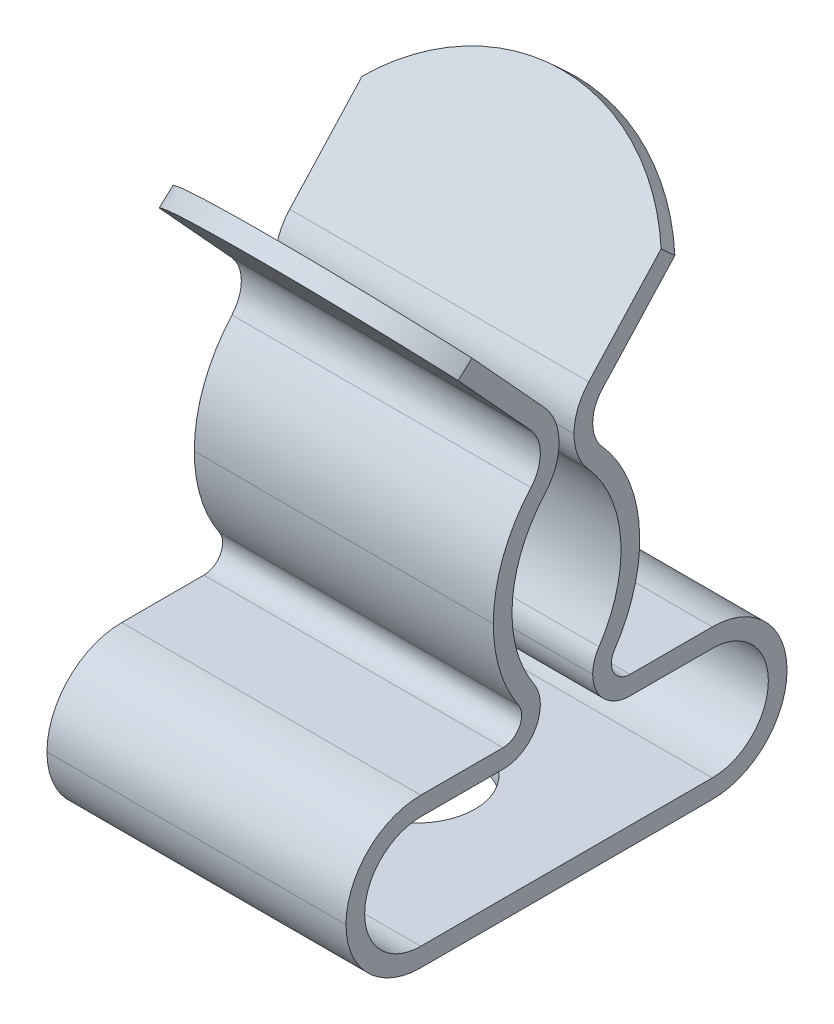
ISO-10303-21;
HEADER;
FILE_DESCRIPTION(('STEP AP214'),'2;1');
FILE_NAME('part.step','',(''),(''),'','','');
FILE_SCHEMA(('AUTOMOTIVE_DESIGN { 1 0 10303 214 1 1 1 1 }'));
ENDSEC;
DATA;
#1=APPLICATION_CONTEXT('core data for automotive mechanical design processes');
#2=APPLICATION_PROTOCOL_DEFINITION('international standard','automotive_design',2000,#1);
#3=PRODUCT_CONTEXT('',#1,'mechanical');
#4=PRODUCT('Part','Part','',(#3));
#5=PRODUCT_RELATED_PRODUCT_CATEGORY('part','',(#4));
#6=PRODUCT_DEFINITION_FORMATION('','',#4);
#7=PRODUCT_DEFINITION_CONTEXT('part definition',#1,'design');
#8=PRODUCT_DEFINITION('design','',#6,#7);
#9=PRODUCT_DEFINITION_SHAPE('','',#8);
#10=(LENGTH_UNIT() NAMED_UNIT(*) SI_UNIT(.MILLI.,.METRE.));
#11=(NAMED_UNIT(*) PLANE_ANGLE_UNIT() SI_UNIT($,.RADIAN.));
#12=(NAMED_UNIT(*) SI_UNIT($,.STERADIAN.) SOLID_ANGLE_UNIT());
#13=UNCERTAINTY_MEASURE_WITH_UNIT(LENGTH_MEASURE(1.E-05),#10,'distance_accuracy_value','');
#14=(GEOMETRIC_REPRESENTATION_CONTEXT(3) GLOBAL_UNCERTAINTY_ASSIGNED_CONTEXT((#13)) GLOBAL_UNIT_ASSIGNED_CONTEXT((#10,
#11,#12)) REPRESENTATION_CONTEXT('',''));
#15=CARTESIAN_POINT('',(0.,0.,0.));
#16=DIRECTION('',(0.,0.,1.));
#17=DIRECTION('',(1.,0.,0.));
#18=AXIS2_PLACEMENT_3D('',#15,#16,#17);
#19=CARTESIAN_POINT('',(36.4639094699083,-12.2939015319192,0.));
#20=DIRECTION('',(0.,-1.,0.));
#21=DIRECTION('',(-1.,0.,0.));
#22=AXIS2_PLACEMENT_3D('',#19,#20,#21);
#23=CYLINDRICAL_SURFACE('',#22,1.55);
#24=DIRECTION('',(0.,-1.,0.));
#25=VECTOR('',#24,1.);
#26=CARTESIAN_POINT('',(38.0139094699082,-12.2939015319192,0.));
#27=LINE('',#26,#25);
#28=CARTESIAN_POINT('',(38.0139094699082,-11.7939015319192,0.));
#29=VERTEX_POINT('',#28);
#30=CARTESIAN_POINT('',(38.0139094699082,-12.2939015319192,0.));
#31=VERTEX_POINT('',#30);
#32=EDGE_CURVE('E719',#29,#31,#27,.T.);
#33=ORIENTED_EDGE('',*,*,#32,.F.);
#34=CARTESIAN_POINT('',(36.4639094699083,-11.7939015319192,0.));
#35=DIRECTION('',(0.,1.,0.));
#36=DIRECTION('',(1.,0.,0.));
#37=AXIS2_PLACEMENT_3D('',#34,#35,#36);
#38=CIRCLE('',#37,1.55);
#39=CARTESIAN_POINT('',(34.9139094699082,-11.7939015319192,0.));
#40=VERTEX_POINT('',#39);
#41=EDGE_CURVE('E690',#29,#40,#38,.T.);
#42=ORIENTED_EDGE('',*,*,#41,.T.);
#43=DIRECTION('',(0.,-1.,0.));
#44=VECTOR('',#43,1.);
#45=CARTESIAN_POINT('',(34.9139094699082,-12.2939015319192,0.));
#46=LINE('',#45,#44);
#47=CARTESIAN_POINT('',(34.9139094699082,-12.2939015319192,0.));
#48=VERTEX_POINT('',#47);
#49=EDGE_CURVE('E718',#40,#48,#46,.T.);
#50=ORIENTED_EDGE('',*,*,#49,.T.);
#51=CARTESIAN_POINT('',(36.4639094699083,-12.2939015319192,0.));
#52=DIRECTION('',(0.,-1.,0.));
#53=DIRECTION('',(-1.,0.,0.));
#54=AXIS2_PLACEMENT_3D('',#51,#52,#53);
#55=CIRCLE('',#54,1.55);
#56=EDGE_CURVE('E375',#48,#31,#55,.T.);
#57=ORIENTED_EDGE('',*,*,#56,.T.);
#58=EDGE_LOOP('',(#33,#42,#50,#57));
#59=FACE_BOUND('',#58,.T.);
#60=ADVANCED_FACE('F15',(#59),#23,.F.);
#61=CARTESIAN_POINT('',(36.4639094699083,3.80922573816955,-4.81352127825));
#62=DIRECTION('',(0.,-0.675590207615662,0.737277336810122));
#63=DIRECTION('',(0.,-0.737277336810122,-0.675590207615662));
#64=AXIS2_PLACEMENT_3D('',#61,#62,#63);
#65=CYLINDRICAL_SURFACE('',#64,5.);
#66=CARTESIAN_POINT('',(36.4639094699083,-1.0628444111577,0.503410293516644));
#67=DIRECTION('',(0.,-0.675590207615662,0.737277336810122));
#68=DIRECTION('',(0.,0.737277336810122,0.675590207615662));
#69=AXIS2_PLACEMENT_3D('',#66,#67,#68);
#70=CIRCLE('',#69,5.);
#71=CARTESIAN_POINT('',(40.4639094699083,1.1489875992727,2.53018091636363));
#72=VERTEX_POINT('',#71);
#73=CARTESIAN_POINT('',(32.4639094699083,1.14898759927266,2.53018091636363));
#74=VERTEX_POINT('',#73);
#75=EDGE_CURVE('E541',#72,#74,#70,.T.);
#76=ORIENTED_EDGE('',*,*,#75,.T.);
#77=DIRECTION('',(0.,-0.675590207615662,0.737277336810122));
#78=VECTOR('',#77,1.);
#79=CARTESIAN_POINT('',(32.4639094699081,6.02105774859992,-2.78675065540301));
#80=LINE('',#79,#78);
#81=CARTESIAN_POINT('',(32.4639094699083,0.811192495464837,2.89881958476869));
#82=VERTEX_POINT('',#81);
#83=EDGE_CURVE('E568',#74,#82,#80,.T.);
#84=ORIENTED_EDGE('',*,*,#83,.T.);
#85=CARTESIAN_POINT('',(36.4639094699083,-1.40063951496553,0.872048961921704));
#86=DIRECTION('',(0.,0.675590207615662,-0.737277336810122));
#87=DIRECTION('',(0.,-0.737277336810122,-0.675590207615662));
#88=AXIS2_PLACEMENT_3D('',#85,#86,#87);
#89=CIRCLE('',#88,5.);
#90=CARTESIAN_POINT('',(40.4639094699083,0.811192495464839,2.89881958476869));
#91=VERTEX_POINT('',#90);
#92=EDGE_CURVE('E561',#82,#91,#89,.T.);
#93=ORIENTED_EDGE('',*,*,#92,.T.);
#94=DIRECTION('',(0.,-0.675590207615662,0.737277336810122));
#95=VECTOR('',#94,1.);
#96=CARTESIAN_POINT('',(40.4639094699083,6.02105774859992,-2.78675065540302));
#97=LINE('',#96,#95);
#98=EDGE_CURVE('E354',#72,#91,#97,.T.);
#99=ORIENTED_EDGE('',*,*,#98,.F.);
#100=EDGE_LOOP('',(#76,#84,#93,#99));
#101=FACE_BOUND('',#100,.T.);
#102=ADVANCED_FACE('F797',(#101),#65,.T.);
#103=CARTESIAN_POINT('',(36.4639094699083,3.80922573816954,4.81352127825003));
#104=DIRECTION('',(0.,-0.675590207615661,-0.737277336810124));
#105=DIRECTION('',(0.,0.737277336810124,-0.675590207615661));
#106=AXIS2_PLACEMENT_3D('',#103,#104,#105);
#107=CYLINDRICAL_SURFACE('',#106,5.);
#108=DIRECTION('',(0.,-0.675590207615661,-0.737277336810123));
#109=VECTOR('',#108,1.);
#110=CARTESIAN_POINT('',(36.4639094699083,7.49561242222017,1.43557024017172));
#111=LINE('',#110,#109);
#112=CARTESIAN_POINT('',(36.4639094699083,2.62354227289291,-3.88136133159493));
#113=VERTEX_POINT('',#112);
#114=CARTESIAN_POINT('',(36.4639094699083,2.28574716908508,-4.25));
#115=VERTEX_POINT('',#114);
#116=EDGE_CURVE('E332',#113,#115,#111,.T.);
#117=ORIENTED_EDGE('',*,*,#116,.F.);
#118=CARTESIAN_POINT('',(36.4639094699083,-1.06284441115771,-0.503410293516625));
#119=DIRECTION('',(0.,-0.675590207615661,-0.737277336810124));
#120=DIRECTION('',(0.,-0.737277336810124,0.675590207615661));
#121=AXIS2_PLACEMENT_3D('',#118,#119,#120);
#122=CIRCLE('',#121,5.);
#123=CARTESIAN_POINT('',(40.4639094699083,1.14898759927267,-2.53018091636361));
#124=VERTEX_POINT('',#123);
#125=EDGE_CURVE('E474',#113,#124,#122,.T.);
#126=ORIENTED_EDGE('',*,*,#125,.T.);
#127=DIRECTION('',(0.,-0.675590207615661,-0.737277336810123));
#128=VECTOR('',#127,1.);
#129=CARTESIAN_POINT('',(40.4639094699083,6.02105774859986,2.78675065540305));
#130=LINE('',#129,#128);
#131=CARTESIAN_POINT('',(40.4639094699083,0.811192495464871,-2.89881958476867));
#132=VERTEX_POINT('',#131);
#133=EDGE_CURVE('E614',#124,#132,#130,.T.);
#134=ORIENTED_EDGE('',*,*,#133,.T.);
#135=CARTESIAN_POINT('',(36.4639094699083,-1.40063951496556,-0.872048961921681));
#136=DIRECTION('',(0.,0.675590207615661,0.737277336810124));
#137=DIRECTION('',(0.,-0.737277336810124,0.675590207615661));
#138=AXIS2_PLACEMENT_3D('',#135,#136,#137);
#139=CIRCLE('',#138,5.);
#140=EDGE_CURVE('E644',#132,#115,#139,.T.);
#141=ORIENTED_EDGE('',*,*,#140,.T.);
#142=EDGE_LOOP('',(#117,#126,#134,#141));
#143=FACE_BOUND('',#142,.T.);
#144=ADVANCED_FACE('F755',(#143),#107,.T.);
#145=CARTESIAN_POINT('',(40.4639094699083,-1.97727674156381,-1.7));
#146=DIRECTION('',(-1.,0.,0.));
#147=DIRECTION('',(0.,0.,1.));
#148=AXIS2_PLACEMENT_3D('',#145,#146,#147);
#149=CYLINDRICAL_SURFACE('',#148,1.);
#150=DIRECTION('',(-1.,0.,0.));
#151=VECTOR('',#150,1.);
#152=CARTESIAN_POINT('',(40.4639094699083,-1.97727674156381,-0.69999999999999));
#153=LINE('',#152,#151);
#154=CARTESIAN_POINT('',(40.4639094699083,-1.97727674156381,-0.69999999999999));
#155=VERTEX_POINT('',#154);
#156=CARTESIAN_POINT('',(32.4639094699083,-1.97727674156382,-0.69999999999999));
#157=VERTEX_POINT('',#156);
#158=EDGE_CURVE('E366',#155,#157,#153,.T.);
#159=ORIENTED_EDGE('',*,*,#158,.F.);
#160=CARTESIAN_POINT('',(40.4639094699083,-1.97727674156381,-1.7));
#161=DIRECTION('',(-1.,0.,0.));
#162=DIRECTION('',(0.,0.,1.));
#163=AXIS2_PLACEMENT_3D('',#160,#161,#162);
#164=CIRCLE('',#163,1.);
#165=CARTESIAN_POINT('',(40.4639094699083,-2.6406016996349,-0.951668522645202));
#166=VERTEX_POINT('',#165);
#167=EDGE_CURVE('E607',#166,#155,#164,.T.);
#168=ORIENTED_EDGE('',*,*,#167,.F.);
#169=DIRECTION('',(-1.,0.,0.));
#170=VECTOR('',#169,1.);
#171=CARTESIAN_POINT('',(40.4639094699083,-2.6406016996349,-0.951668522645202));
#172=LINE('',#171,#170);
#173=CARTESIAN_POINT('',(32.4639094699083,-2.6406016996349,-0.951668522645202));
#174=VERTEX_POINT('',#173);
#175=EDGE_CURVE('E10',#166,#174,#172,.T.);
#176=ORIENTED_EDGE('',*,*,#175,.T.);
#177=CARTESIAN_POINT('',(32.4639094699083,-1.97727674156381,-1.7));
#178=DIRECTION('',(-1.,0.,0.));
#179=DIRECTION('',(0.,0.,1.));
#180=AXIS2_PLACEMENT_3D('',#177,#178,#179);
#181=CIRCLE('',#180,1.);
#182=EDGE_CURVE('E670',#174,#157,#181,.T.);
#183=ORIENTED_EDGE('',*,*,#182,.T.);
#184=EDGE_LOOP('',(#159,#168,#176,#183));
#185=FACE_BOUND('',#184,.T.);
#186=ADVANCED_FACE('F794',(#185),#149,.F.);
#187=CARTESIAN_POINT('',(40.4639094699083,-5.29390153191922,2.04165738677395));
#188=DIRECTION('',(-1.,0.,0.));
#189=DIRECTION('',(0.,0.,1.));
#190=AXIS2_PLACEMENT_3D('',#187,#188,#189);
#191=CYLINDRICAL_SURFACE('',#190,4.);
#192=CARTESIAN_POINT('',(32.4639094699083,-5.29390153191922,2.04165738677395));
#193=DIRECTION('',(1.,0.,0.));
#194=DIRECTION('',(0.,0.,-1.));
#195=AXIS2_PLACEMENT_3D('',#192,#193,#194);
#196=CIRCLE('',#195,4.);
#197=CARTESIAN_POINT('',(32.4639094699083,-7.51612375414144,-1.28426029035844));
#198=VERTEX_POINT('',#197);
#199=EDGE_CURVE('E671',#198,#174,#196,.T.);
#200=ORIENTED_EDGE('',*,*,#199,.T.);
#201=ORIENTED_EDGE('',*,*,#175,.F.);
#202=CARTESIAN_POINT('',(40.4639094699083,-5.29390153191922,2.04165738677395));
#203=DIRECTION('',(1.,0.,0.));
#204=DIRECTION('',(0.,0.,-1.));
#205=AXIS2_PLACEMENT_3D('',#202,#203,#204);
#206=CIRCLE('',#205,4.);
#207=CARTESIAN_POINT('',(40.4639094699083,-7.51612375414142,-1.28426029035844));
#208=VERTEX_POINT('',#207);
#209=EDGE_CURVE('E601',#208,#166,#206,.T.);
#210=ORIENTED_EDGE('',*,*,#209,.F.);
#211=DIRECTION('',(-1.,0.,0.));
#212=VECTOR('',#211,1.);
#213=CARTESIAN_POINT('',(40.4639094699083,-7.51612375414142,-1.28426029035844));
#214=LINE('',#213,#212);
#215=EDGE_CURVE('E353',#208,#198,#214,.T.);
#216=ORIENTED_EDGE('',*,*,#215,.T.);
#217=EDGE_LOOP('',(#200,#201,#210,#216));
#218=FACE_BOUND('',#217,.T.);
#219=ADVANCED_FACE('F772',(#218),#191,.T.);
#220=CARTESIAN_POINT('',(40.4639094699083,-7.79390153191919,-1.7));
#221=DIRECTION('',(-1.,0.,0.));
#222=DIRECTION('',(0.,0.,1.));
#223=AXIS2_PLACEMENT_3D('',#220,#221,#222);
#224=CYLINDRICAL_SURFACE('',#223,0.5);
#225=DIRECTION('',(-1.,0.,0.));
#226=VECTOR('',#225,1.);
#227=CARTESIAN_POINT('',(40.4639094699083,-7.79390153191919,-1.2));
#228=LINE('',#227,#226);
#229=CARTESIAN_POINT('',(40.4639094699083,-7.79390153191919,-1.2));
#230=VERTEX_POINT('',#229);
#231=CARTESIAN_POINT('',(32.4639094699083,-7.79390153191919,-1.2));
#232=VERTEX_POINT('',#231);
#233=EDGE_CURVE('E334',#230,#232,#228,.T.);
#234=ORIENTED_EDGE('',*,*,#233,.F.);
#235=CARTESIAN_POINT('',(40.4639094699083,-7.79390153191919,-1.7));
#236=DIRECTION('',(-1.,0.,0.));
#237=DIRECTION('',(0.,0.,1.));
#238=AXIS2_PLACEMENT_3D('',#235,#236,#237);
#239=CIRCLE('',#238,0.5);
#240=CARTESIAN_POINT('',(40.4639094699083,-8.2939015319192,-1.7));
#241=VERTEX_POINT('',#240);
#242=EDGE_CURVE('E598',#241,#230,#239,.T.);
#243=ORIENTED_EDGE('',*,*,#242,.F.);
#244=DIRECTION('',(-1.,0.,0.));
#245=VECTOR('',#244,1.);
#246=CARTESIAN_POINT('',(40.4639094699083,-8.2939015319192,-1.7));
#247=LINE('',#246,#245);
#248=CARTESIAN_POINT('',(32.4639094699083,-8.29390153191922,-1.7));
#249=VERTEX_POINT('',#248);
#250=EDGE_CURVE('E25',#241,#249,#247,.T.);
#251=ORIENTED_EDGE('',*,*,#250,.T.);
#252=CARTESIAN_POINT('',(32.4639094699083,-7.7939015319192,-1.7));
#253=DIRECTION('',(-1.,0.,0.));
#254=DIRECTION('',(0.,0.,1.));
#255=AXIS2_PLACEMENT_3D('',#252,#253,#254);
#256=CIRCLE('',#255,0.5);
#257=EDGE_CURVE('E675',#249,#232,#256,.T.);
#258=ORIENTED_EDGE('',*,*,#257,.T.);
#259=EDGE_LOOP('',(#234,#243,#251,#258));
#260=FACE_BOUND('',#259,.T.);
#261=ADVANCED_FACE('F782',(#260),#224,.F.);
#262=CARTESIAN_POINT('',(40.4639094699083,-8.2939015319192,-3.9));
#263=DIRECTION('',(0.,-1.,0.));
#264=DIRECTION('',(-1.,0.,0.));
#265=AXIS2_PLACEMENT_3D('',#262,#263,#264);
#266=PLANE('',#265);
#267=DIRECTION('',(0.,0.,1.));
#268=VECTOR('',#267,1.);
#269=CARTESIAN_POINT('',(32.4639094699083,-8.29390153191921,-3.9));
#270=LINE('',#269,#268);
#271=CARTESIAN_POINT('',(32.4639094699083,-8.29390153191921,-3.9));
#272=VERTEX_POINT('',#271);
#273=EDGE_CURVE('E418',#272,#249,#270,.T.);
#274=ORIENTED_EDGE('',*,*,#273,.T.);
#275=ORIENTED_EDGE('',*,*,#250,.F.);
#276=DIRECTION('',(0.,0.,1.));
#277=VECTOR('',#276,1.);
#278=CARTESIAN_POINT('',(40.4639094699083,-8.2939015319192,-3.9));
#279=LINE('',#278,#277);
#280=CARTESIAN_POINT('',(40.4639094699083,-8.2939015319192,-3.9));
#281=VERTEX_POINT('',#280);
#282=EDGE_CURVE('E594',#281,#241,#279,.T.);
#283=ORIENTED_EDGE('',*,*,#282,.F.);
#284=DIRECTION('',(-1.,0.,0.));
#285=VECTOR('',#284,1.);
#286=CARTESIAN_POINT('',(40.4639094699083,-8.2939015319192,-3.9));
#287=LINE('',#286,#285);
#288=EDGE_CURVE('E372',#281,#272,#287,.T.);
#289=ORIENTED_EDGE('',*,*,#288,.T.);
#290=EDGE_LOOP('',(#274,#275,#283,#289));
#291=FACE_BOUND('',#290,.T.);
#292=ADVANCED_FACE('F784',(#291),#266,.F.);
#293=CARTESIAN_POINT('',(40.4639094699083,-10.2939015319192,-3.9));
#294=DIRECTION('',(-1.,0.,0.));
#295=DIRECTION('',(0.,0.,1.));
#296=AXIS2_PLACEMENT_3D('',#293,#294,#295);
#297=CYLINDRICAL_SURFACE('',#296,2.);
#298=CARTESIAN_POINT('',(32.4639094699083,-10.2939015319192,-3.9));
#299=DIRECTION('',(1.,0.,0.));
#300=DIRECTION('',(0.,0.,-1.));
#301=AXIS2_PLACEMENT_3D('',#298,#299,#300);
#302=CIRCLE('',#301,2.);
#303=CARTESIAN_POINT('',(32.4639094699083,-12.2939015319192,-3.9));
#304=VERTEX_POINT('',#303);
#305=EDGE_CURVE('E328',#304,#272,#302,.T.);
#306=ORIENTED_EDGE('',*,*,#305,.T.);
#307=ORIENTED_EDGE('',*,*,#288,.F.);
#308=CARTESIAN_POINT('',(40.4639094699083,-10.2939015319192,-3.9));
#309=DIRECTION('',(1.,0.,0.));
#310=DIRECTION('',(0.,0.,-1.));
#311=AXIS2_PLACEMENT_3D('',#308,#309,#310);
#312=CIRCLE('',#311,2.);
#313=CARTESIAN_POINT('',(40.4639094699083,-12.2939015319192,-3.9));
#314=VERTEX_POINT('',#313);
#315=EDGE_CURVE('E590',#314,#281,#312,.T.);
#316=ORIENTED_EDGE('',*,*,#315,.F.);
#317=DIRECTION('',(-1.,0.,0.));
#318=VECTOR('',#317,1.);
#319=CARTESIAN_POINT('',(40.4639094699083,-12.2939015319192,-3.9));
#320=LINE('',#319,#318);
#321=EDGE_CURVE('E306',#314,#304,#320,.T.);
#322=ORIENTED_EDGE('',*,*,#321,.T.);
#323=EDGE_LOOP('',(#306,#307,#316,#322));
#324=FACE_BOUND('',#323,.T.);
#325=ADVANCED_FACE('F791',(#324),#297,.T.);
#326=CARTESIAN_POINT('',(40.4639094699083,-12.2939015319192,-3.9));
#327=DIRECTION('',(0.,1.,0.));
#328=DIRECTION('',(-1.,0.,0.));
#329=AXIS2_PLACEMENT_3D('',#326,#327,#328);
#330=PLANE('',#329);
#331=ORIENTED_EDGE('',*,*,#56,.F.);
#332=CARTESIAN_POINT('',(36.4639094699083,-12.2939015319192,0.));
#333=DIRECTION('',(0.,-1.,0.));
#334=DIRECTION('',(-1.,0.,0.));
#335=AXIS2_PLACEMENT_3D('',#332,#333,#334);
#336=CIRCLE('',#335,1.55);
#337=EDGE_CURVE('E715',#31,#48,#336,.T.);
#338=ORIENTED_EDGE('',*,*,#337,.F.);
#339=EDGE_LOOP('',(#331,#338));
#340=FACE_BOUND('',#339,.T.);
#341=DIRECTION('',(0.,0.,-1.));
#342=VECTOR('',#341,1.);
#343=CARTESIAN_POINT('',(32.4639094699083,-12.2939015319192,-3.9));
#344=LINE('',#343,#342);
#345=CARTESIAN_POINT('',(32.4639094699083,-12.2939015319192,3.9));
#346=VERTEX_POINT('',#345);
#347=EDGE_CURVE('E322',#346,#304,#344,.T.);
#348=ORIENTED_EDGE('',*,*,#347,.T.);
#349=ORIENTED_EDGE('',*,*,#321,.F.);
#350=DIRECTION('',(0.,0.,-1.));
#351=VECTOR('',#350,1.);
#352=CARTESIAN_POINT('',(40.4639094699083,-12.2939015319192,-3.9));
#353=LINE('',#352,#351);
#354=CARTESIAN_POINT('',(40.4639094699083,-12.2939015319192,3.9));
#355=VERTEX_POINT('',#354);
#356=EDGE_CURVE('E409',#355,#314,#353,.T.);
#357=ORIENTED_EDGE('',*,*,#356,.F.);
#358=DIRECTION('',(-1.,0.,0.));
#359=VECTOR('',#358,1.);
#360=CARTESIAN_POINT('',(40.4639094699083,-12.2939015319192,3.9));
#361=LINE('',#360,#359);
#362=EDGE_CURVE('E406',#355,#346,#361,.T.);
#363=ORIENTED_EDGE('',*,*,#362,.T.);
#364=EDGE_LOOP('',(#348,#349,#357,#363));
#365=FACE_BOUND('',#364,.T.);
#366=ADVANCED_FACE('F851',(#340,#365),#330,.F.);
#367=CARTESIAN_POINT('',(40.4639094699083,-10.2939015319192,3.9));
#368=DIRECTION('',(-1.,0.,0.));
#369=DIRECTION('',(0.,0.,1.));
#370=AXIS2_PLACEMENT_3D('',#367,#368,#369);
#371=CYLINDRICAL_SURFACE('',#370,2.);
#372=DIRECTION('',(-1.,0.,0.));
#373=VECTOR('',#372,1.);
#374=CARTESIAN_POINT('',(40.4639094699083,-10.2939015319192,5.9));
#375=LINE('',#374,#373);
#376=CARTESIAN_POINT('',(40.4639094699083,-10.2939015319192,5.9));
#377=VERTEX_POINT('',#376);
#378=CARTESIAN_POINT('',(32.4639094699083,-10.2939015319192,5.9));
#379=VERTEX_POINT('',#378);
#380=EDGE_CURVE('E395',#377,#379,#375,.T.);
#381=ORIENTED_EDGE('',*,*,#380,.F.);
#382=CARTESIAN_POINT('',(40.4639094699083,-10.2939015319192,3.9));
#383=DIRECTION('',(1.,0.,0.));
#384=DIRECTION('',(0.,0.,1.));
#385=AXIS2_PLACEMENT_3D('',#382,#383,#384);
#386=CIRCLE('',#385,2.);
#387=CARTESIAN_POINT('',(40.4639094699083,-8.29390153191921,3.9));
#388=VERTEX_POINT('',#387);
#389=EDGE_CURVE('E301',#388,#377,#386,.T.);
#390=ORIENTED_EDGE('',*,*,#389,.F.);
#391=DIRECTION('',(-1.,0.,0.));
#392=VECTOR('',#391,1.);
#393=CARTESIAN_POINT('',(40.4639094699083,-8.29390153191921,3.9));
#394=LINE('',#393,#392);
#395=CARTESIAN_POINT('',(32.4639094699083,-8.29390153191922,3.9));
#396=VERTEX_POINT('',#395);
#397=EDGE_CURVE('E18',#388,#396,#394,.T.);
#398=ORIENTED_EDGE('',*,*,#397,.T.);
#399=CARTESIAN_POINT('',(32.4639094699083,-10.2939015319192,3.9));
#400=DIRECTION('',(1.,0.,0.));
#401=DIRECTION('',(0.,0.,1.));
#402=AXIS2_PLACEMENT_3D('',#399,#400,#401);
#403=CIRCLE('',#402,2.);
#404=EDGE_CURVE('E299',#396,#379,#403,.T.);
#405=ORIENTED_EDGE('',*,*,#404,.T.);
#406=EDGE_LOOP('',(#381,#390,#398,#405));
#407=FACE_BOUND('',#406,.T.);
#408=ADVANCED_FACE('F297',(#407),#371,.T.);
#409=CARTESIAN_POINT('',(40.4639094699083,-8.29390153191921,3.9));
#410=DIRECTION('',(0.,-1.,0.));
#411=DIRECTION('',(0.,0.,1.));
#412=AXIS2_PLACEMENT_3D('',#409,#410,#411);
#413=PLANE('',#412);
#414=DIRECTION('',(0.,0.,1.));
#415=VECTOR('',#414,1.);
#416=CARTESIAN_POINT('',(32.4639094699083,-8.29390153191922,3.9));
#417=LINE('',#416,#415);
#418=CARTESIAN_POINT('',(32.4639094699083,-8.29390153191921,1.7));
#419=VERTEX_POINT('',#418);
#420=EDGE_CURVE('E309',#419,#396,#417,.T.);
#421=ORIENTED_EDGE('',*,*,#420,.T.);
#422=ORIENTED_EDGE('',*,*,#397,.F.);
#423=DIRECTION('',(0.,0.,1.));
#424=VECTOR('',#423,1.);
#425=CARTESIAN_POINT('',(40.4639094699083,-8.29390153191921,3.9));
#426=LINE('',#425,#424);
#427=CARTESIAN_POINT('',(40.4639094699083,-8.2939015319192,1.7));
#428=VERTEX_POINT('',#427);
#429=EDGE_CURVE('E410',#428,#388,#426,.T.);
#430=ORIENTED_EDGE('',*,*,#429,.F.);
#431=DIRECTION('',(-1.,0.,0.));
#432=VECTOR('',#431,1.);
#433=CARTESIAN_POINT('',(40.4639094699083,-8.2939015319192,1.7));
#434=LINE('',#433,#432);
#435=EDGE_CURVE('E307',#428,#419,#434,.T.);
#436=ORIENTED_EDGE('',*,*,#435,.T.);
#437=EDGE_LOOP('',(#421,#422,#430,#436));
#438=FACE_BOUND('',#437,.T.);
#439=ADVANCED_FACE('F310',(#438),#413,.F.);
#440=CARTESIAN_POINT('',(40.4639094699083,-7.79390153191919,1.7));
#441=DIRECTION('',(-1.,0.,0.));
#442=DIRECTION('',(0.,0.,1.));
#443=AXIS2_PLACEMENT_3D('',#440,#441,#442);
#444=CYLINDRICAL_SURFACE('',#443,0.5);
#445=CARTESIAN_POINT('',(32.4639094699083,-7.79390153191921,1.7));
#446=DIRECTION('',(-1.,0.,0.));
#447=DIRECTION('',(0.,0.,-1.));
#448=AXIS2_PLACEMENT_3D('',#445,#446,#447);
#449=CIRCLE('',#448,0.5);
#450=CARTESIAN_POINT('',(32.4639094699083,-7.51612375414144,1.28426029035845));
#451=VERTEX_POINT('',#450);
#452=EDGE_CURVE('E314',#451,#419,#449,.T.);
#453=ORIENTED_EDGE('',*,*,#452,.T.);
#454=ORIENTED_EDGE('',*,*,#435,.F.);
#455=CARTESIAN_POINT('',(40.4639094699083,-7.79390153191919,1.7));
#456=DIRECTION('',(-1.,0.,0.));
#457=DIRECTION('',(0.,0.,-1.));
#458=AXIS2_PLACEMENT_3D('',#455,#456,#457);
#459=CIRCLE('',#458,0.5);
#460=CARTESIAN_POINT('',(40.4639094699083,-7.51612375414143,1.28426029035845));
#461=VERTEX_POINT('',#460);
#462=EDGE_CURVE('E581',#461,#428,#459,.T.);
#463=ORIENTED_EDGE('',*,*,#462,.F.);
#464=DIRECTION('',(-1.,0.,0.));
#465=VECTOR('',#464,1.);
#466=CARTESIAN_POINT('',(40.4639094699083,-7.51612375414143,1.28426029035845));
#467=LINE('',#466,#465);
#468=EDGE_CURVE('E429',#461,#451,#467,.T.);
#469=ORIENTED_EDGE('',*,*,#468,.T.);
#470=EDGE_LOOP('',(#453,#454,#463,#469));
#471=FACE_BOUND('',#470,.T.);
#472=ADVANCED_FACE('F945',(#471),#444,.F.);
#473=CARTESIAN_POINT('',(40.4639094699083,-5.29390153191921,-2.04165738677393));
#474=DIRECTION('',(-1.,0.,0.));
#475=DIRECTION('',(0.,0.,1.));
#476=AXIS2_PLACEMENT_3D('',#473,#474,#475);
#477=CYLINDRICAL_SURFACE('',#476,4.);
#478=DIRECTION('',(-1.,0.,0.));
#479=VECTOR('',#478,1.);
#480=CARTESIAN_POINT('',(40.4639094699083,-5.29390153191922,1.95834261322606));
#481=LINE('',#480,#479);
#482=CARTESIAN_POINT('',(40.4639094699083,-5.29390153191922,1.95834261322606));
#483=VERTEX_POINT('',#482);
#484=CARTESIAN_POINT('',(32.4639094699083,-5.29390153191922,1.95834261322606));
#485=VERTEX_POINT('',#484);
#486=EDGE_CURVE('E422',#483,#485,#481,.T.);
#487=ORIENTED_EDGE('',*,*,#486,.F.);
#488=CARTESIAN_POINT('',(40.4639094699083,-5.29390153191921,-2.04165738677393));
#489=DIRECTION('',(1.,0.,0.));
#490=DIRECTION('',(0.,0.,1.));
#491=AXIS2_PLACEMENT_3D('',#488,#489,#490);
#492=CIRCLE('',#491,4.);
#493=CARTESIAN_POINT('',(40.4639094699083,-2.64060169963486,0.95166852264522));
#494=VERTEX_POINT('',#493);
#495=EDGE_CURVE('E578',#494,#483,#492,.T.);
#496=ORIENTED_EDGE('',*,*,#495,.F.);
#497=DIRECTION('',(-1.,0.,0.));
#498=VECTOR('',#497,1.);
#499=CARTESIAN_POINT('',(40.4639094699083,-2.64060169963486,0.95166852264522));
#500=LINE('',#499,#498);
#501=CARTESIAN_POINT('',(32.4639094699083,-2.64060169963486,0.95166852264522));
#502=VERTEX_POINT('',#501);
#503=EDGE_CURVE('E37',#494,#502,#500,.T.);
#504=ORIENTED_EDGE('',*,*,#503,.T.);
#505=CARTESIAN_POINT('',(32.4639094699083,-5.29390153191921,-2.04165738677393));
#506=DIRECTION('',(1.,0.,0.));
#507=DIRECTION('',(0.,0.,1.));
#508=AXIS2_PLACEMENT_3D('',#505,#506,#507);
#509=CIRCLE('',#508,4.);
#510=EDGE_CURVE('E439',#502,#485,#509,.T.);
#511=ORIENTED_EDGE('',*,*,#510,.T.);
#512=EDGE_LOOP('',(#487,#496,#504,#511));
#513=FACE_BOUND('',#512,.T.);
#514=ADVANCED_FACE('F942',(#513),#477,.T.);
#515=CARTESIAN_POINT('',(40.4639094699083,-1.97727674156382,1.7));
#516=DIRECTION('',(-1.,0.,0.));
#517=DIRECTION('',(0.,0.,1.));
#518=AXIS2_PLACEMENT_3D('',#515,#516,#517);
#519=CYLINDRICAL_SURFACE('',#518,1.);
#520=CARTESIAN_POINT('',(32.4639094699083,-1.97727674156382,1.7));
#521=DIRECTION('',(-1.,0.,0.));
#522=DIRECTION('',(0.,0.,-1.));
#523=AXIS2_PLACEMENT_3D('',#520,#521,#522);
#524=CIRCLE('',#523,1.);
#525=CARTESIAN_POINT('',(32.4639094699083,-1.30168653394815,0.962722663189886));
#526=VERTEX_POINT('',#525);
#527=EDGE_CURVE('E435',#526,#502,#524,.T.);
#528=ORIENTED_EDGE('',*,*,#527,.T.);
#529=ORIENTED_EDGE('',*,*,#503,.F.);
#530=CARTESIAN_POINT('',(40.4639094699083,-1.97727674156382,1.7));
#531=DIRECTION('',(-1.,0.,0.));
#532=DIRECTION('',(0.,0.,-1.));
#533=AXIS2_PLACEMENT_3D('',#530,#531,#532);
#534=CIRCLE('',#533,1.);
#535=CARTESIAN_POINT('',(40.4639094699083,-1.30168653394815,0.962722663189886));
#536=VERTEX_POINT('',#535);
#537=EDGE_CURVE('E357',#536,#494,#534,.T.);
#538=ORIENTED_EDGE('',*,*,#537,.F.);
#539=DIRECTION('',(-1.,0.,0.));
#540=VECTOR('',#539,1.);
#541=CARTESIAN_POINT('',(40.4639094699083,-1.30168653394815,0.962722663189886));
#542=LINE('',#541,#540);
#543=EDGE_CURVE('E358',#536,#526,#542,.T.);
#544=ORIENTED_EDGE('',*,*,#543,.T.);
#545=EDGE_LOOP('',(#528,#529,#538,#544));
#546=FACE_BOUND('',#545,.T.);
#547=ADVANCED_FACE('F940',(#546),#519,.F.);
#548=CARTESIAN_POINT('',(40.4639094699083,-1.97727674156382,1.7));
#549=DIRECTION('',(-1.,0.,0.));
#550=DIRECTION('',(0.,0.,1.));
#551=AXIS2_PLACEMENT_3D('',#548,#549,#550);
#552=CYLINDRICAL_SURFACE('',#551,1.5);
#553=CARTESIAN_POINT('',(32.4639094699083,-1.97727674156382,1.7));
#554=DIRECTION('',(-1.,0.,0.));
#555=DIRECTION('',(0.,0.,-1.));
#556=AXIS2_PLACEMENT_3D('',#553,#554,#555);
#557=CIRCLE('',#556,1.5);
#558=CARTESIAN_POINT('',(32.4639094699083,-0.96389143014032,0.594083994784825));
#559=VERTEX_POINT('',#558);
#560=CARTESIAN_POINT('',(32.4639094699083,-2.97226417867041,0.577502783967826));
#561=VERTEX_POINT('',#560);
#562=EDGE_CURVE('E401',#559,#561,#557,.T.);
#563=ORIENTED_EDGE('',*,*,#562,.F.);
#564=DIRECTION('',(-1.,0.,0.));
#565=VECTOR('',#564,1.);
#566=CARTESIAN_POINT('',(40.4639094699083,-0.963891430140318,0.594083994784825));
#567=LINE('',#566,#565);
#568=CARTESIAN_POINT('',(40.4639094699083,-0.963891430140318,0.594083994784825));
#569=VERTEX_POINT('',#568);
#570=EDGE_CURVE('E549',#569,#559,#567,.T.);
#571=ORIENTED_EDGE('',*,*,#570,.F.);
#572=CARTESIAN_POINT('',(40.4639094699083,-1.97727674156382,1.7));
#573=DIRECTION('',(-1.,0.,0.));
#574=DIRECTION('',(0.,0.,-1.));
#575=AXIS2_PLACEMENT_3D('',#572,#573,#574);
#576=CIRCLE('',#575,1.5);
#577=CARTESIAN_POINT('',(40.4639094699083,-2.97226417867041,0.577502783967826));
#578=VERTEX_POINT('',#577);
#579=EDGE_CURVE('E484',#569,#578,#576,.T.);
#580=ORIENTED_EDGE('',*,*,#579,.T.);
#581=DIRECTION('',(-1.,0.,0.));
#582=VECTOR('',#581,1.);
#583=CARTESIAN_POINT('',(40.4639094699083,-2.97226417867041,0.577502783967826));
#584=LINE('',#583,#582);
#585=EDGE_CURVE('E455',#578,#561,#584,.T.);
#586=ORIENTED_EDGE('',*,*,#585,.T.);
#587=EDGE_LOOP('',(#563,#571,#580,#586));
#588=FACE_BOUND('',#587,.T.);
#589=ADVANCED_FACE('F936',(#588),#552,.T.);
#590=CARTESIAN_POINT('',(40.4639094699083,-5.29390153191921,-2.04165738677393));
#591=DIRECTION('',(-1.,0.,0.));
#592=DIRECTION('',(0.,0.,1.));
#593=AXIS2_PLACEMENT_3D('',#590,#591,#592);
#594=CYLINDRICAL_SURFACE('',#593,3.5);
#595=DIRECTION('',(-1.,0.,0.));
#596=VECTOR('',#595,1.);
#597=CARTESIAN_POINT('',(40.4639094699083,-5.29390153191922,1.45834261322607));
#598=LINE('',#597,#596);
#599=CARTESIAN_POINT('',(40.4639094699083,-5.29390153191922,1.45834261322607));
#600=VERTEX_POINT('',#599);
#601=CARTESIAN_POINT('',(32.4639094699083,-5.29390153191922,1.45834261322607));
#602=VERTEX_POINT('',#601);
#603=EDGE_CURVE('E443',#600,#602,#598,.T.);
#604=ORIENTED_EDGE('',*,*,#603,.F.);
#605=CARTESIAN_POINT('',(40.4639094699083,-5.29390153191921,-2.04165738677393));
#606=DIRECTION('',(1.,0.,0.));
#607=DIRECTION('',(0.,0.,-1.));
#608=AXIS2_PLACEMENT_3D('',#605,#606,#607);
#609=CIRCLE('',#608,3.5);
#610=CARTESIAN_POINT('',(40.4639094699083,-7.23834597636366,0.868520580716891));
#611=VERTEX_POINT('',#610);
#612=EDGE_CURVE('E480',#600,#611,#609,.T.);
#613=ORIENTED_EDGE('',*,*,#612,.T.);
#614=DIRECTION('',(-1.,0.,0.));
#615=VECTOR('',#614,1.);
#616=CARTESIAN_POINT('',(40.4639094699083,-7.23834597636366,0.868520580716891));
#617=LINE('',#616,#615);
#618=CARTESIAN_POINT('',(32.4639094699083,-7.23834597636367,0.868520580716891));
#619=VERTEX_POINT('',#618);
#620=EDGE_CURVE('E448',#611,#619,#617,.T.);
#621=ORIENTED_EDGE('',*,*,#620,.T.);
#622=CARTESIAN_POINT('',(32.4639094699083,-5.29390153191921,-2.04165738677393));
#623=DIRECTION('',(1.,0.,0.));
#624=DIRECTION('',(0.,0.,-1.));
#625=AXIS2_PLACEMENT_3D('',#622,#623,#624);
#626=CIRCLE('',#625,3.5);
#627=EDGE_CURVE('E396',#602,#619,#626,.T.);
#628=ORIENTED_EDGE('',*,*,#627,.F.);
#629=EDGE_LOOP('',(#604,#613,#621,#628));
#630=FACE_BOUND('',#629,.T.);
#631=ADVANCED_FACE('F933',(#630),#594,.F.);
#632=CARTESIAN_POINT('',(40.4639094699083,-7.79390153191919,1.7));
#633=DIRECTION('',(-1.,0.,0.));
#634=DIRECTION('',(0.,0.,1.));
#635=AXIS2_PLACEMENT_3D('',#632,#633,#634);
#636=CYLINDRICAL_SURFACE('',#635,1.);
#637=CARTESIAN_POINT('',(32.4639094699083,-7.79390153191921,1.7));
#638=DIRECTION('',(-1.,0.,0.));
#639=DIRECTION('',(0.,0.,-1.));
#640=AXIS2_PLACEMENT_3D('',#637,#638,#639);
#641=CIRCLE('',#640,1.);
#642=CARTESIAN_POINT('',(32.4639094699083,-8.79390153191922,1.7));
#643=VERTEX_POINT('',#642);
#644=EDGE_CURVE('E400',#619,#643,#641,.T.);
#645=ORIENTED_EDGE('',*,*,#644,.F.);
#646=ORIENTED_EDGE('',*,*,#620,.F.);
#647=CARTESIAN_POINT('',(40.4639094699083,-7.79390153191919,1.7));
#648=DIRECTION('',(-1.,0.,0.));
#649=DIRECTION('',(0.,0.,-1.));
#650=AXIS2_PLACEMENT_3D('',#647,#648,#649);
#651=CIRCLE('',#650,1.);
#652=CARTESIAN_POINT('',(40.4639094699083,-8.79390153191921,1.7));
#653=VERTEX_POINT('',#652);
#654=EDGE_CURVE('E485',#611,#653,#651,.T.);
#655=ORIENTED_EDGE('',*,*,#654,.T.);
#656=DIRECTION('',(-1.,0.,0.));
#657=VECTOR('',#656,1.);
#658=CARTESIAN_POINT('',(40.4639094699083,-8.79390153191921,1.7));
#659=LINE('',#658,#657);
#660=EDGE_CURVE('E451',#653,#643,#659,.T.);
#661=ORIENTED_EDGE('',*,*,#660,.T.);
#662=EDGE_LOOP('',(#645,#646,#655,#661));
#663=FACE_BOUND('',#662,.T.);
#664=ADVANCED_FACE('F698',(#663),#636,.T.);
#665=CARTESIAN_POINT('',(40.4639094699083,-8.79390153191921,3.9));
#666=DIRECTION('',(0.,-1.,0.));
#667=DIRECTION('',(0.,0.,1.));
#668=AXIS2_PLACEMENT_3D('',#665,#666,#667);
#669=PLANE('',#668);
#670=DIRECTION('',(0.,0.,1.));
#671=VECTOR('',#670,1.);
#672=CARTESIAN_POINT('',(32.4639094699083,-8.79390153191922,3.9));
#673=LINE('',#672,#671);
#674=CARTESIAN_POINT('',(32.4639094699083,-8.79390153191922,3.9));
#675=VERTEX_POINT('',#674);
#676=EDGE_CURVE('E657',#643,#675,#673,.T.);
#677=ORIENTED_EDGE('',*,*,#676,.F.);
#678=ORIENTED_EDGE('',*,*,#660,.F.);
#679=DIRECTION('',(0.,0.,1.));
#680=VECTOR('',#679,1.);
#681=CARTESIAN_POINT('',(40.4639094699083,-8.79390153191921,3.9));
#682=LINE('',#681,#680);
#683=CARTESIAN_POINT('',(40.4639094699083,-8.79390153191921,3.9));
#684=VERTEX_POINT('',#683);
#685=EDGE_CURVE('E630',#653,#684,#682,.T.);
#686=ORIENTED_EDGE('',*,*,#685,.T.);
#687=DIRECTION('',(-1.,0.,0.));
#688=VECTOR('',#687,1.);
#689=CARTESIAN_POINT('',(40.4639094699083,-8.79390153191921,3.9));
#690=LINE('',#689,#688);
#691=EDGE_CURVE('E489',#684,#675,#690,.T.);
#692=ORIENTED_EDGE('',*,*,#691,.T.);
#693=EDGE_LOOP('',(#677,#678,#686,#692));
#694=FACE_BOUND('',#693,.T.);
#695=ADVANCED_FACE('F703',(#694),#669,.T.);
#696=CARTESIAN_POINT('',(40.4639094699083,-10.2939015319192,3.9));
#697=DIRECTION('',(-1.,0.,0.));
#698=DIRECTION('',(0.,0.,1.));
#699=AXIS2_PLACEMENT_3D('',#696,#697,#698);
#700=CYLINDRICAL_SURFACE('',#699,1.5);
#701=DIRECTION('',(-1.,0.,0.));
#702=VECTOR('',#701,1.);
#703=CARTESIAN_POINT('',(40.4639094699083,-10.2939015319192,5.4));
#704=LINE('',#703,#702);
#705=CARTESIAN_POINT('',(40.4639094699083,-10.2939015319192,5.4));
#706=VERTEX_POINT('',#705);
#707=CARTESIAN_POINT('',(32.4639094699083,-10.2939015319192,5.4));
#708=VERTEX_POINT('',#707);
#709=EDGE_CURVE('E469',#706,#708,#704,.T.);
#710=ORIENTED_EDGE('',*,*,#709,.F.);
#711=CARTESIAN_POINT('',(40.4639094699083,-10.2939015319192,3.9));
#712=DIRECTION('',(1.,0.,0.));
#713=DIRECTION('',(0.,0.,-1.));
#714=AXIS2_PLACEMENT_3D('',#711,#712,#713);
#715=CIRCLE('',#714,1.5);
#716=CARTESIAN_POINT('',(40.4639094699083,-11.7939015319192,3.9));
#717=VERTEX_POINT('',#716);
#718=EDGE_CURVE('E464',#706,#717,#715,.T.);
#719=ORIENTED_EDGE('',*,*,#718,.T.);
#720=DIRECTION('',(-1.,0.,0.));
#721=VECTOR('',#720,1.);
#722=CARTESIAN_POINT('',(40.4639094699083,-11.7939015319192,3.9));
#723=LINE('',#722,#721);
#724=CARTESIAN_POINT('',(32.4639094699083,-11.7939015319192,3.9));
#725=VERTEX_POINT('',#724);
#726=EDGE_CURVE('E529',#717,#725,#723,.T.);
#727=ORIENTED_EDGE('',*,*,#726,.T.);
#728=CARTESIAN_POINT('',(32.4639094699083,-10.2939015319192,3.9));
#729=DIRECTION('',(1.,0.,0.));
#730=DIRECTION('',(0.,0.,-1.));
#731=AXIS2_PLACEMENT_3D('',#728,#729,#730);
#732=CIRCLE('',#731,1.5);
#733=EDGE_CURVE('E652',#708,#725,#732,.T.);
#734=ORIENTED_EDGE('',*,*,#733,.F.);
#735=EDGE_LOOP('',(#710,#719,#727,#734));
#736=FACE_BOUND('',#735,.T.);
#737=ADVANCED_FACE('F888',(#736),#700,.F.);
#738=CARTESIAN_POINT('',(40.4639094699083,-11.7939015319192,-3.9));
#739=DIRECTION('',(0.,1.,0.));
#740=DIRECTION('',(-1.,0.,0.));
#741=AXIS2_PLACEMENT_3D('',#738,#739,#740);
#742=PLANE('',#741);
#743=CARTESIAN_POINT('',(36.4639094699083,-11.7939015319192,0.));
#744=DIRECTION('',(0.,1.,0.));
#745=DIRECTION('',(1.,0.,0.));
#746=AXIS2_PLACEMENT_3D('',#743,#744,#745);
#747=CIRCLE('',#746,1.55);
#748=EDGE_CURVE('E817',#40,#29,#747,.T.);
#749=ORIENTED_EDGE('',*,*,#748,.F.);
#750=ORIENTED_EDGE('',*,*,#41,.F.);
#751=EDGE_LOOP('',(#749,#750));
#752=FACE_BOUND('',#751,.T.);
#753=DIRECTION('',(0.,0.,-1.));
#754=VECTOR('',#753,1.);
#755=CARTESIAN_POINT('',(32.4639094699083,-11.7939015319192,-3.9));
#756=LINE('',#755,#754);
#757=CARTESIAN_POINT('',(32.4639094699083,-11.7939015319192,-3.9));
#758=VERTEX_POINT('',#757);
#759=EDGE_CURVE('E656',#725,#758,#756,.T.);
#760=ORIENTED_EDGE('',*,*,#759,.F.);
#761=ORIENTED_EDGE('',*,*,#726,.F.);
#762=DIRECTION('',(0.,0.,-1.));
#763=VECTOR('',#762,1.);
#764=CARTESIAN_POINT('',(40.4639094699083,-11.7939015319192,-3.9));
#765=LINE('',#764,#763);
#766=CARTESIAN_POINT('',(40.4639094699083,-11.7939015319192,-3.9));
#767=VERTEX_POINT('',#766);
#768=EDGE_CURVE('E460',#717,#767,#765,.T.);
#769=ORIENTED_EDGE('',*,*,#768,.T.);
#770=DIRECTION('',(-1.,0.,0.));
#771=VECTOR('',#770,1.);
#772=CARTESIAN_POINT('',(40.4639094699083,-11.7939015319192,-3.9));
#773=LINE('',#772,#771);
#774=EDGE_CURVE('E526',#767,#758,#773,.T.);
#775=ORIENTED_EDGE('',*,*,#774,.T.);
#776=EDGE_LOOP('',(#760,#761,#769,#775));
#777=FACE_BOUND('',#776,.T.);
#778=ADVANCED_FACE('F884',(#752,#777),#742,.T.);
#779=CARTESIAN_POINT('',(40.4639094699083,-10.2939015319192,-3.9));
#780=DIRECTION('',(-1.,0.,0.));
#781=DIRECTION('',(0.,0.,1.));
#782=AXIS2_PLACEMENT_3D('',#779,#780,#781);
#783=CYLINDRICAL_SURFACE('',#782,1.5);
#784=CARTESIAN_POINT('',(32.4639094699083,-10.2939015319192,-3.9));
#785=DIRECTION('',(1.,0.,0.));
#786=DIRECTION('',(0.,0.,-1.));
#787=AXIS2_PLACEMENT_3D('',#784,#785,#786);
#788=CIRCLE('',#787,1.5);
#789=CARTESIAN_POINT('',(32.4639094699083,-8.79390153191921,-3.9));
#790=VERTEX_POINT('',#789);
#791=EDGE_CURVE('E378',#758,#790,#788,.T.);
#792=ORIENTED_EDGE('',*,*,#791,.F.);
#793=ORIENTED_EDGE('',*,*,#774,.F.);
#794=CARTESIAN_POINT('',(40.4639094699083,-10.2939015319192,-3.9));
#795=DIRECTION('',(1.,0.,0.));
#796=DIRECTION('',(0.,0.,-1.));
#797=AXIS2_PLACEMENT_3D('',#794,#795,#796);
#798=CIRCLE('',#797,1.5);
#799=CARTESIAN_POINT('',(40.4639094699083,-8.7939015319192,-3.9));
#800=VERTEX_POINT('',#799);
#801=EDGE_CURVE('E465',#767,#800,#798,.T.);
#802=ORIENTED_EDGE('',*,*,#801,.T.);
#803=DIRECTION('',(-1.,0.,0.));
#804=VECTOR('',#803,1.);
#805=CARTESIAN_POINT('',(40.4639094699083,-8.7939015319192,-3.9));
#806=LINE('',#805,#804);
#807=EDGE_CURVE('E513',#800,#790,#806,.T.);
#808=ORIENTED_EDGE('',*,*,#807,.T.);
#809=EDGE_LOOP('',(#792,#793,#802,#808));
#810=FACE_BOUND('',#809,.T.);
#811=ADVANCED_FACE('F887',(#810),#783,.F.);
#812=CARTESIAN_POINT('',(40.4639094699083,-8.7939015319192,-3.9));
#813=DIRECTION('',(0.,-1.,0.));
#814=DIRECTION('',(-1.,0.,0.));
#815=AXIS2_PLACEMENT_3D('',#812,#813,#814);
#816=PLANE('',#815);
#817=DIRECTION('',(0.,0.,1.));
#818=VECTOR('',#817,1.);
#819=CARTESIAN_POINT('',(32.4639094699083,-8.79390153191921,-3.9));
#820=LINE('',#819,#818);
#821=CARTESIAN_POINT('',(32.4639094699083,-8.79390153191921,-1.7));
#822=VERTEX_POINT('',#821);
#823=EDGE_CURVE('E344',#790,#822,#820,.T.);
#824=ORIENTED_EDGE('',*,*,#823,.F.);
#825=ORIENTED_EDGE('',*,*,#807,.F.);
#826=DIRECTION('',(0.,0.,1.));
#827=VECTOR('',#826,1.);
#828=CARTESIAN_POINT('',(40.4639094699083,-8.7939015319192,-3.9));
#829=LINE('',#828,#827);
#830=CARTESIAN_POINT('',(40.4639094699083,-8.79390153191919,-1.7));
#831=VERTEX_POINT('',#830);
#832=EDGE_CURVE('E521',#800,#831,#829,.T.);
#833=ORIENTED_EDGE('',*,*,#832,.T.);
#834=DIRECTION('',(-1.,0.,0.));
#835=VECTOR('',#834,1.);
#836=CARTESIAN_POINT('',(40.4639094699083,-8.79390153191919,-1.7));
#837=LINE('',#836,#835);
#838=EDGE_CURVE('E510',#831,#822,#837,.T.);
#839=ORIENTED_EDGE('',*,*,#838,.T.);
#840=EDGE_LOOP('',(#824,#825,#833,#839));
#841=FACE_BOUND('',#840,.T.);
#842=ADVANCED_FACE('F918',(#841),#816,.T.);
#843=CARTESIAN_POINT('',(40.4639094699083,-7.79390153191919,-1.7));
#844=DIRECTION('',(-1.,0.,0.));
#845=DIRECTION('',(0.,0.,1.));
#846=AXIS2_PLACEMENT_3D('',#843,#844,#845);
#847=CYLINDRICAL_SURFACE('',#846,1.);
#848=DIRECTION('',(-1.,0.,0.));
#849=VECTOR('',#848,1.);
#850=CARTESIAN_POINT('',(40.4639094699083,-7.79390153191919,-0.7));
#851=LINE('',#850,#849);
#852=CARTESIAN_POINT('',(40.4639094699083,-7.79390153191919,-0.7));
#853=VERTEX_POINT('',#852);
#854=CARTESIAN_POINT('',(32.4639094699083,-7.79390153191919,-0.7));
#855=VERTEX_POINT('',#854);
#856=EDGE_CURVE('E497',#853,#855,#851,.T.);
#857=ORIENTED_EDGE('',*,*,#856,.F.);
#858=CARTESIAN_POINT('',(40.4639094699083,-7.79390153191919,-1.7));
#859=DIRECTION('',(-1.,0.,0.));
#860=DIRECTION('',(0.,0.,-1.));
#861=AXIS2_PLACEMENT_3D('',#858,#859,#860);
#862=CIRCLE('',#861,1.);
#863=CARTESIAN_POINT('',(40.4639094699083,-7.23834597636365,-0.868520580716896));
#864=VERTEX_POINT('',#863);
#865=EDGE_CURVE('E621',#853,#864,#862,.T.);
#866=ORIENTED_EDGE('',*,*,#865,.T.);
#867=DIRECTION('',(-1.,0.,0.));
#868=VECTOR('',#867,1.);
#869=CARTESIAN_POINT('',(40.4639094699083,-7.23834597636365,-0.868520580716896));
#870=LINE('',#869,#868);
#871=CARTESIAN_POINT('',(32.4639094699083,-7.23834597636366,-0.868520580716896));
#872=VERTEX_POINT('',#871);
#873=EDGE_CURVE('E438',#864,#872,#870,.T.);
#874=ORIENTED_EDGE('',*,*,#873,.T.);
#875=CARTESIAN_POINT('',(32.4639094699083,-7.7939015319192,-1.7));
#876=DIRECTION('',(-1.,0.,0.));
#877=DIRECTION('',(0.,0.,-1.));
#878=AXIS2_PLACEMENT_3D('',#875,#876,#877);
#879=CIRCLE('',#878,1.);
#880=EDGE_CURVE('E339',#855,#872,#879,.T.);
#881=ORIENTED_EDGE('',*,*,#880,.F.);
#882=EDGE_LOOP('',(#857,#866,#874,#881));
#883=FACE_BOUND('',#882,.T.);
#884=ADVANCED_FACE('F914',(#883),#847,.T.);
#885=CARTESIAN_POINT('',(40.4639094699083,-5.29390153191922,2.04165738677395));
#886=DIRECTION('',(-1.,0.,0.));
#887=DIRECTION('',(0.,0.,1.));
#888=AXIS2_PLACEMENT_3D('',#885,#886,#887);
#889=CYLINDRICAL_SURFACE('',#888,3.5);
#890=CARTESIAN_POINT('',(32.4639094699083,-5.29390153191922,2.04165738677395));
#891=DIRECTION('',(1.,0.,0.));
#892=DIRECTION('',(0.,0.,-1.));
#893=AXIS2_PLACEMENT_3D('',#890,#891,#892);
#894=CIRCLE('',#893,3.5);
#895=CARTESIAN_POINT('',(32.4639094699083,-2.97226417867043,-0.577502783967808));
#896=VERTEX_POINT('',#895);
#897=EDGE_CURVE('E343',#872,#896,#894,.T.);
#898=ORIENTED_EDGE('',*,*,#897,.F.);
#899=ORIENTED_EDGE('',*,*,#873,.F.);
#900=CARTESIAN_POINT('',(40.4639094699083,-5.29390153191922,2.04165738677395));
#901=DIRECTION('',(1.,0.,0.));
#902=DIRECTION('',(0.,0.,-1.));
#903=AXIS2_PLACEMENT_3D('',#900,#901,#902);
#904=CIRCLE('',#903,3.5);
#905=CARTESIAN_POINT('',(40.4639094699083,-2.97226417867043,-0.577502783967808));
#906=VERTEX_POINT('',#905);
#907=EDGE_CURVE('E390',#864,#906,#904,.T.);
#908=ORIENTED_EDGE('',*,*,#907,.T.);
#909=DIRECTION('',(-1.,0.,0.));
#910=VECTOR('',#909,1.);
#911=CARTESIAN_POINT('',(40.4639094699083,-2.97226417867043,-0.577502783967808));
#912=LINE('',#911,#910);
#913=EDGE_CURVE('E537',#906,#896,#912,.T.);
#914=ORIENTED_EDGE('',*,*,#913,.T.);
#915=EDGE_LOOP('',(#898,#899,#908,#914));
#916=FACE_BOUND('',#915,.T.);
#917=ADVANCED_FACE('F910',(#916),#889,.F.);
#918=CARTESIAN_POINT('',(40.4639094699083,-1.97727674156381,-1.7));
#919=DIRECTION('',(-1.,0.,0.));
#920=DIRECTION('',(0.,0.,1.));
#921=AXIS2_PLACEMENT_3D('',#918,#919,#920);
#922=CYLINDRICAL_SURFACE('',#921,1.5);
#923=DIRECTION('',(-1.,0.,0.));
#924=VECTOR('',#923,1.);
#925=CARTESIAN_POINT('',(40.4639094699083,-1.97727674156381,-0.19999999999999));
#926=LINE('',#925,#924);
#927=CARTESIAN_POINT('',(40.4639094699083,-1.97727674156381,-0.19999999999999));
#928=VERTEX_POINT('',#927);
#929=CARTESIAN_POINT('',(32.4639094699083,-1.97727674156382,-0.19999999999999));
#930=VERTEX_POINT('',#929);
#931=EDGE_CURVE('E525',#928,#930,#926,.T.);
#932=ORIENTED_EDGE('',*,*,#931,.F.);
#933=CARTESIAN_POINT('',(40.4639094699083,-1.97727674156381,-1.7));
#934=DIRECTION('',(-1.,0.,0.));
#935=DIRECTION('',(0.,0.,-1.));
#936=AXIS2_PLACEMENT_3D('',#933,#934,#935);
#937=CIRCLE('',#936,1.5);
#938=CARTESIAN_POINT('',(40.4639094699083,-0.963891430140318,-0.594083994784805));
#939=VERTEX_POINT('',#938);
#940=EDGE_CURVE('E386',#928,#939,#937,.T.);
#941=ORIENTED_EDGE('',*,*,#940,.T.);
#942=DIRECTION('',(-1.,0.,0.));
#943=VECTOR('',#942,1.);
#944=CARTESIAN_POINT('',(40.4639094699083,-0.963891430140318,-0.594083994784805));
#945=LINE('',#944,#943);
#946=CARTESIAN_POINT('',(32.4639094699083,-0.96389143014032,-0.594083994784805));
#947=VERTEX_POINT('',#946);
#948=EDGE_CURVE('E470',#939,#947,#945,.T.);
#949=ORIENTED_EDGE('',*,*,#948,.T.);
#950=CARTESIAN_POINT('',(32.4639094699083,-1.97727674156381,-1.7));
#951=DIRECTION('',(-1.,0.,0.));
#952=DIRECTION('',(0.,0.,-1.));
#953=AXIS2_PLACEMENT_3D('',#950,#951,#952);
#954=CIRCLE('',#953,1.5);
#955=EDGE_CURVE('E666',#930,#947,#954,.T.);
#956=ORIENTED_EDGE('',*,*,#955,.F.);
#957=EDGE_LOOP('',(#932,#941,#949,#956));
#958=FACE_BOUND('',#957,.T.);
#959=ADVANCED_FACE('F907',(#958),#922,.T.);
#960=CARTESIAN_POINT('',(32.4639094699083,-1.97727674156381,-1.7));
#961=DIRECTION('',(1.,0.,0.));
#962=DIRECTION('',(0.,0.,-1.));
#963=AXIS2_PLACEMENT_3D('',#960,#961,#962);
#964=PLANE('',#963);
#965=DIRECTION('',(0.,-0.737277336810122,-0.675590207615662));
#966=VECTOR('',#965,1.);
#967=CARTESIAN_POINT('',(32.4639094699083,-1.30168653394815,0.962722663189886));
#968=LINE('',#967,#966);
#969=EDGE_CURVE('E565',#82,#526,#968,.T.);
#970=ORIENTED_EDGE('',*,*,#969,.F.);
#971=ORIENTED_EDGE('',*,*,#83,.F.);
#972=DIRECTION('',(0.,-0.737277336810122,-0.675590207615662));
#973=VECTOR('',#972,1.);
#974=CARTESIAN_POINT('',(32.4639094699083,-0.96389143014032,0.594083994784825));
#975=LINE('',#974,#973);
#976=EDGE_CURVE('E553',#74,#559,#975,.T.);
#977=ORIENTED_EDGE('',*,*,#976,.T.);
#978=ORIENTED_EDGE('',*,*,#562,.T.);
#979=CARTESIAN_POINT('',(32.4639094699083,-5.29390153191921,-2.04165738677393));
#980=DIRECTION('',(1.,0.,0.));
#981=DIRECTION('',(0.,0.,-1.));
#982=AXIS2_PLACEMENT_3D('',#979,#980,#981);
#983=CIRCLE('',#982,3.5);
#984=EDGE_CURVE('E447',#561,#602,#983,.T.);
#985=ORIENTED_EDGE('',*,*,#984,.T.);
#986=ORIENTED_EDGE('',*,*,#627,.T.);
#987=ORIENTED_EDGE('',*,*,#644,.T.);
#988=ORIENTED_EDGE('',*,*,#676,.T.);
#989=CARTESIAN_POINT('',(32.4639094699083,-10.2939015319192,3.9));
#990=DIRECTION('',(1.,0.,0.));
#991=DIRECTION('',(0.,0.,-1.));
#992=AXIS2_PLACEMENT_3D('',#989,#990,#991);
#993=CIRCLE('',#992,1.5);
#994=EDGE_CURVE('E479',#675,#708,#993,.T.);
#995=ORIENTED_EDGE('',*,*,#994,.T.);
#996=ORIENTED_EDGE('',*,*,#733,.T.);
#997=ORIENTED_EDGE('',*,*,#759,.T.);
#998=ORIENTED_EDGE('',*,*,#791,.T.);
#999=ORIENTED_EDGE('',*,*,#823,.T.);
#1000=CARTESIAN_POINT('',(32.4639094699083,-7.7939015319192,-1.7));
#1001=DIRECTION('',(-1.,0.,0.));
#1002=DIRECTION('',(0.,0.,-1.));
#1003=AXIS2_PLACEMENT_3D('',#1000,#1001,#1002);
#1004=CIRCLE('',#1003,1.);
#1005=EDGE_CURVE('E504',#822,#855,#1004,.T.);
#1006=ORIENTED_EDGE('',*,*,#1005,.T.);
#1007=ORIENTED_EDGE('',*,*,#880,.T.);
#1008=ORIENTED_EDGE('',*,*,#897,.T.);
#1009=CARTESIAN_POINT('',(32.4639094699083,-1.97727674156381,-1.7));
#1010=DIRECTION('',(-1.,0.,0.));
#1011=DIRECTION('',(0.,0.,-1.));
#1012=AXIS2_PLACEMENT_3D('',#1009,#1010,#1011);
#1013=CIRCLE('',#1012,1.5);
#1014=EDGE_CURVE('E533',#896,#930,#1013,.T.);
#1015=ORIENTED_EDGE('',*,*,#1014,.T.);
#1016=ORIENTED_EDGE('',*,*,#955,.T.);
#1017=DIRECTION('',(0.,0.737277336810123,-0.675590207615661));
#1018=VECTOR('',#1017,1.);
#1019=CARTESIAN_POINT('',(32.4639094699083,-0.96389143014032,-0.594083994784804));
#1020=LINE('',#1019,#1018);
#1021=CARTESIAN_POINT('',(32.4639094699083,1.14898759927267,-2.53018091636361));
#1022=VERTEX_POINT('',#1021);
#1023=EDGE_CURVE('E475',#947,#1022,#1020,.T.);
#1024=ORIENTED_EDGE('',*,*,#1023,.T.);
#1025=DIRECTION('',(0.,0.675590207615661,0.737277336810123));
#1026=VECTOR('',#1025,1.);
#1027=CARTESIAN_POINT('',(32.4639094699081,6.02105774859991,2.78675065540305));
#1028=LINE('',#1027,#1026);
#1029=CARTESIAN_POINT('',(32.4639094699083,0.811192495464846,-2.89881958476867));
#1030=VERTEX_POINT('',#1029);
#1031=EDGE_CURVE('E349',#1030,#1022,#1028,.T.);
#1032=ORIENTED_EDGE('',*,*,#1031,.F.);
#1033=DIRECTION('',(0.,0.737277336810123,-0.675590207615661));
#1034=VECTOR('',#1033,1.);
#1035=CARTESIAN_POINT('',(32.4639094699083,-1.30168653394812,-0.962722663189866));
#1036=LINE('',#1035,#1034);
#1037=CARTESIAN_POINT('',(32.4639094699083,-1.30168653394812,-0.962722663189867));
#1038=VERTEX_POINT('',#1037);
#1039=EDGE_CURVE('E640',#1038,#1030,#1036,.T.);
#1040=ORIENTED_EDGE('',*,*,#1039,.F.);
#1041=CARTESIAN_POINT('',(32.4639094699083,-1.97727674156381,-1.7));
#1042=DIRECTION('',(-1.,0.,0.));
#1043=DIRECTION('',(0.,0.,1.));
#1044=AXIS2_PLACEMENT_3D('',#1041,#1042,#1043);
#1045=CIRCLE('',#1044,1.);
#1046=EDGE_CURVE('E371',#157,#1038,#1045,.T.);
#1047=ORIENTED_EDGE('',*,*,#1046,.F.);
#1048=ORIENTED_EDGE('',*,*,#182,.F.);
#1049=ORIENTED_EDGE('',*,*,#199,.F.);
#1050=CARTESIAN_POINT('',(32.4639094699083,-7.7939015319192,-1.7));
#1051=DIRECTION('',(-1.,0.,0.));
#1052=DIRECTION('',(0.,0.,1.));
#1053=AXIS2_PLACEMENT_3D('',#1050,#1051,#1052);
#1054=CIRCLE('',#1053,0.5);
#1055=EDGE_CURVE('E337',#232,#198,#1054,.T.);
#1056=ORIENTED_EDGE('',*,*,#1055,.F.);
#1057=ORIENTED_EDGE('',*,*,#257,.F.);
#1058=ORIENTED_EDGE('',*,*,#273,.F.);
#1059=ORIENTED_EDGE('',*,*,#305,.F.);
#1060=ORIENTED_EDGE('',*,*,#347,.F.);
#1061=CARTESIAN_POINT('',(32.4639094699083,-10.2939015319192,3.9));
#1062=DIRECTION('',(1.,0.,0.));
#1063=DIRECTION('',(0.,0.,1.));
#1064=AXIS2_PLACEMENT_3D('',#1061,#1062,#1063);
#1065=CIRCLE('',#1064,2.);
#1066=EDGE_CURVE('E319',#379,#346,#1065,.T.);
#1067=ORIENTED_EDGE('',*,*,#1066,.F.);
#1068=ORIENTED_EDGE('',*,*,#404,.F.);
#1069=ORIENTED_EDGE('',*,*,#420,.F.);
#1070=ORIENTED_EDGE('',*,*,#452,.F.);
#1071=CARTESIAN_POINT('',(32.4639094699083,-5.29390153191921,-2.04165738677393));
#1072=DIRECTION('',(1.,0.,0.));
#1073=DIRECTION('',(0.,0.,1.));
#1074=AXIS2_PLACEMENT_3D('',#1071,#1072,#1073);
#1075=CIRCLE('',#1074,4.);
#1076=EDGE_CURVE('E426',#485,#451,#1075,.T.);
#1077=ORIENTED_EDGE('',*,*,#1076,.F.);
#1078=ORIENTED_EDGE('',*,*,#510,.F.);
#1079=ORIENTED_EDGE('',*,*,#527,.F.);
#1080=EDGE_LOOP('',(#970,#971,#977,#978,#985,#986,#987,#988,#995,#996,#997,#998,#999,#1006,
#1007,#1008,#1015,#1016,#1024,#1032,#1040,#1047,#1048,#1049,#1056,#1057,#1058,#1059,#1060,#1067,
#1068,#1069,#1070,#1077,#1078,#1079));
#1081=FACE_BOUND('',#1080,.T.);
#1082=ADVANCED_FACE('F317',(#1081),#964,.F.);
#1083=CARTESIAN_POINT('',(40.4639094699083,-0.963891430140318,-0.594083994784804));
#1084=DIRECTION('',(0.,0.675590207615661,0.737277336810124));
#1085=DIRECTION('',(1.,0.,0.));
#1086=AXIS2_PLACEMENT_3D('',#1083,#1084,#1085);
#1087=PLANE('',#1086);
#1088=CARTESIAN_POINT('',(36.4639094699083,-1.06284441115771,-0.503410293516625));
#1089=DIRECTION('',(0.,-0.675590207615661,-0.737277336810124));
#1090=DIRECTION('',(0.,-0.737277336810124,0.675590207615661));
#1091=AXIS2_PLACEMENT_3D('',#1088,#1089,#1090);
#1092=CIRCLE('',#1091,5.);
#1093=EDGE_CURVE('E728',#1022,#113,#1092,.T.);
#1094=ORIENTED_EDGE('',*,*,#1093,.F.);
#1095=ORIENTED_EDGE('',*,*,#1023,.F.);
#1096=ORIENTED_EDGE('',*,*,#948,.F.);
#1097=DIRECTION('',(0.,0.737277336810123,-0.675590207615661));
#1098=VECTOR('',#1097,1.);
#1099=CARTESIAN_POINT('',(40.4639094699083,-0.963891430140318,-0.594083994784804));
#1100=LINE('',#1099,#1098);
#1101=EDGE_CURVE('E391',#939,#124,#1100,.T.);
#1102=ORIENTED_EDGE('',*,*,#1101,.T.);
#1103=ORIENTED_EDGE('',*,*,#125,.F.);
#1104=EDGE_LOOP('',(#1094,#1095,#1096,#1102,#1103));
#1105=FACE_BOUND('',#1104,.T.);
#1106=ADVANCED_FACE('F747',(#1105),#1087,.T.);
#1107=CARTESIAN_POINT('',(40.4639094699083,-1.30168653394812,-0.962722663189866));
#1108=DIRECTION('',(0.,0.675590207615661,0.737277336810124));
#1109=DIRECTION('',(1.,0.,0.));
#1110=AXIS2_PLACEMENT_3D('',#1107,#1108,#1109);
#1111=PLANE('',#1110);
#1112=ORIENTED_EDGE('',*,*,#1039,.T.);
#1113=CARTESIAN_POINT('',(36.4639094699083,-1.40063951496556,-0.872048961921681));
#1114=DIRECTION('',(0.,0.675590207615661,0.737277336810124));
#1115=DIRECTION('',(0.,-0.737277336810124,0.675590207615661));
#1116=AXIS2_PLACEMENT_3D('',#1113,#1114,#1115);
#1117=CIRCLE('',#1116,5.);
#1118=EDGE_CURVE('E345',#115,#1030,#1117,.T.);
#1119=ORIENTED_EDGE('',*,*,#1118,.F.);
#1120=ORIENTED_EDGE('',*,*,#140,.F.);
#1121=DIRECTION('',(0.,0.737277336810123,-0.675590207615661));
#1122=VECTOR('',#1121,1.);
#1123=CARTESIAN_POINT('',(40.4639094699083,-1.30168653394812,-0.962722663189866));
#1124=LINE('',#1123,#1122);
#1125=CARTESIAN_POINT('',(40.4639094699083,-1.30168653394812,-0.962722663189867));
#1126=VERTEX_POINT('',#1125);
#1127=EDGE_CURVE('E610',#1126,#132,#1124,.T.);
#1128=ORIENTED_EDGE('',*,*,#1127,.F.);
#1129=DIRECTION('',(-1.,0.,0.));
#1130=VECTOR('',#1129,1.);
#1131=CARTESIAN_POINT('',(40.4639094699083,-1.30168653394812,-0.962722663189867));
#1132=LINE('',#1131,#1130);
#1133=EDGE_CURVE('E367',#1126,#1038,#1132,.T.);
#1134=ORIENTED_EDGE('',*,*,#1133,.T.);
#1135=EDGE_LOOP('',(#1112,#1119,#1120,#1128,#1134));
#1136=FACE_BOUND('',#1135,.T.);
#1137=ADVANCED_FACE('F898',(#1136),#1111,.F.);
#1138=CARTESIAN_POINT('',(40.4639094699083,-1.97727674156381,-1.7));
#1139=DIRECTION('',(1.,0.,0.));
#1140=DIRECTION('',(0.,0.,-1.));
#1141=AXIS2_PLACEMENT_3D('',#1138,#1139,#1140);
#1142=PLANE('',#1141);
#1143=DIRECTION('',(0.,-0.737277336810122,-0.675590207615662));
#1144=VECTOR('',#1143,1.);
#1145=CARTESIAN_POINT('',(40.4639094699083,-0.963891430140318,0.594083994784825));
#1146=LINE('',#1145,#1144);
#1147=EDGE_CURVE('E545',#72,#569,#1146,.T.);
#1148=ORIENTED_EDGE('',*,*,#1147,.F.);
#1149=ORIENTED_EDGE('',*,*,#98,.T.);
#1150=DIRECTION('',(0.,-0.737277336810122,-0.675590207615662));
#1151=VECTOR('',#1150,1.);
#1152=CARTESIAN_POINT('',(40.4639094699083,-1.30168653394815,0.962722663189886));
#1153=LINE('',#1152,#1151);
#1154=EDGE_CURVE('E557',#91,#536,#1153,.T.);
#1155=ORIENTED_EDGE('',*,*,#1154,.T.);
#1156=ORIENTED_EDGE('',*,*,#537,.T.);
#1157=ORIENTED_EDGE('',*,*,#495,.T.);
#1158=CARTESIAN_POINT('',(40.4639094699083,-5.29390153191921,-2.04165738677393));
#1159=DIRECTION('',(1.,0.,0.));
#1160=DIRECTION('',(0.,0.,1.));
#1161=AXIS2_PLACEMENT_3D('',#1158,#1159,#1160);
#1162=CIRCLE('',#1161,4.);
#1163=EDGE_CURVE('E414',#483,#461,#1162,.T.);
#1164=ORIENTED_EDGE('',*,*,#1163,.T.);
#1165=ORIENTED_EDGE('',*,*,#462,.T.);
#1166=ORIENTED_EDGE('',*,*,#429,.T.);
#1167=ORIENTED_EDGE('',*,*,#389,.T.);
#1168=CARTESIAN_POINT('',(40.4639094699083,-10.2939015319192,3.9));
#1169=DIRECTION('',(1.,0.,0.));
#1170=DIRECTION('',(0.,0.,1.));
#1171=AXIS2_PLACEMENT_3D('',#1168,#1169,#1170);
#1172=CIRCLE('',#1171,2.);
#1173=EDGE_CURVE('E385',#377,#355,#1172,.T.);
#1174=ORIENTED_EDGE('',*,*,#1173,.T.);
#1175=ORIENTED_EDGE('',*,*,#356,.T.);
#1176=ORIENTED_EDGE('',*,*,#315,.T.);
#1177=ORIENTED_EDGE('',*,*,#282,.T.);
#1178=ORIENTED_EDGE('',*,*,#242,.T.);
#1179=CARTESIAN_POINT('',(40.4639094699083,-7.79390153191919,-1.7));
#1180=DIRECTION('',(-1.,0.,0.));
#1181=DIRECTION('',(0.,0.,1.));
#1182=AXIS2_PLACEMENT_3D('',#1179,#1180,#1181);
#1183=CIRCLE('',#1182,0.5);
#1184=EDGE_CURVE('E338',#230,#208,#1183,.T.);
#1185=ORIENTED_EDGE('',*,*,#1184,.T.);
#1186=ORIENTED_EDGE('',*,*,#209,.T.);
#1187=ORIENTED_EDGE('',*,*,#167,.T.);
#1188=CARTESIAN_POINT('',(40.4639094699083,-1.97727674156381,-1.7));
#1189=DIRECTION('',(-1.,0.,0.));
#1190=DIRECTION('',(0.,0.,1.));
#1191=AXIS2_PLACEMENT_3D('',#1188,#1189,#1190);
#1192=CIRCLE('',#1191,1.);
#1193=EDGE_CURVE('E362',#155,#1126,#1192,.T.);
#1194=ORIENTED_EDGE('',*,*,#1193,.T.);
#1195=ORIENTED_EDGE('',*,*,#1127,.T.);
#1196=ORIENTED_EDGE('',*,*,#133,.F.);
#1197=ORIENTED_EDGE('',*,*,#1101,.F.);
#1198=ORIENTED_EDGE('',*,*,#940,.F.);
#1199=CARTESIAN_POINT('',(40.4639094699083,-1.97727674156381,-1.7));
#1200=DIRECTION('',(-1.,0.,0.));
#1201=DIRECTION('',(0.,0.,-1.));
#1202=AXIS2_PLACEMENT_3D('',#1199,#1200,#1201);
#1203=CIRCLE('',#1202,1.5);
#1204=EDGE_CURVE('E517',#906,#928,#1203,.T.);
#1205=ORIENTED_EDGE('',*,*,#1204,.F.);
#1206=ORIENTED_EDGE('',*,*,#907,.F.);
#1207=ORIENTED_EDGE('',*,*,#865,.F.);
#1208=CARTESIAN_POINT('',(40.4639094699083,-7.79390153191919,-1.7));
#1209=DIRECTION('',(-1.,0.,0.));
#1210=DIRECTION('',(0.,0.,-1.));
#1211=AXIS2_PLACEMENT_3D('',#1208,#1209,#1210);
#1212=CIRCLE('',#1211,1.);
#1213=EDGE_CURVE('E493',#831,#853,#1212,.T.);
#1214=ORIENTED_EDGE('',*,*,#1213,.F.);
#1215=ORIENTED_EDGE('',*,*,#832,.F.);
#1216=ORIENTED_EDGE('',*,*,#801,.F.);
#1217=ORIENTED_EDGE('',*,*,#768,.F.);
#1218=ORIENTED_EDGE('',*,*,#718,.F.);
#1219=CARTESIAN_POINT('',(40.4639094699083,-10.2939015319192,3.9));
#1220=DIRECTION('',(1.,0.,0.));
#1221=DIRECTION('',(0.,0.,-1.));
#1222=AXIS2_PLACEMENT_3D('',#1219,#1220,#1221);
#1223=CIRCLE('',#1222,1.5);
#1224=EDGE_CURVE('E459',#684,#706,#1223,.T.);
#1225=ORIENTED_EDGE('',*,*,#1224,.F.);
#1226=ORIENTED_EDGE('',*,*,#685,.F.);
#1227=ORIENTED_EDGE('',*,*,#654,.F.);
#1228=ORIENTED_EDGE('',*,*,#612,.F.);
#1229=CARTESIAN_POINT('',(40.4639094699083,-5.29390153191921,-2.04165738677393));
#1230=DIRECTION('',(1.,0.,0.));
#1231=DIRECTION('',(0.,0.,-1.));
#1232=AXIS2_PLACEMENT_3D('',#1229,#1230,#1231);
#1233=CIRCLE('',#1232,3.5);
#1234=EDGE_CURVE('E434',#578,#600,#1233,.T.);
#1235=ORIENTED_EDGE('',*,*,#1234,.F.);
#1236=ORIENTED_EDGE('',*,*,#579,.F.);
#1237=EDGE_LOOP('',(#1148,#1149,#1155,#1156,#1157,#1164,#1165,#1166,#1167,#1174,#1175,#1176,
#1177,#1178,#1185,#1186,#1187,#1194,#1195,#1196,#1197,#1198,#1205,#1206,#1207,#1214,#1215,#1216,
#1217,#1218,#1225,#1226,#1227,#1228,#1235,#1236));
#1238=FACE_BOUND('',#1237,.T.);
#1239=ADVANCED_FACE('F779',(#1238),#1142,.T.);
#1240=CARTESIAN_POINT('',(40.4639094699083,-1.30168653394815,0.962722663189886));
#1241=DIRECTION('',(0.,0.675590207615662,-0.737277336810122));
#1242=DIRECTION('',(-1.,0.,0.));
#1243=AXIS2_PLACEMENT_3D('',#1240,#1241,#1242);
#1244=PLANE('',#1243);
#1245=ORIENTED_EDGE('',*,*,#1154,.F.);
#1246=ORIENTED_EDGE('',*,*,#92,.F.);
#1247=ORIENTED_EDGE('',*,*,#969,.T.);
#1248=ORIENTED_EDGE('',*,*,#543,.F.);
#1249=EDGE_LOOP('',(#1245,#1246,#1247,#1248));
#1250=FACE_BOUND('',#1249,.T.);
#1251=ADVANCED_FACE('F893',(#1250),#1244,.F.);
#1252=CARTESIAN_POINT('',(40.4639094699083,-0.963891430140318,0.594083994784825));
#1253=DIRECTION('',(0.,0.675590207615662,-0.737277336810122));
#1254=DIRECTION('',(-1.,0.,0.));
#1255=AXIS2_PLACEMENT_3D('',#1252,#1253,#1254);
#1256=PLANE('',#1255);
#1257=ORIENTED_EDGE('',*,*,#75,.F.);
#1258=ORIENTED_EDGE('',*,*,#1147,.T.);
#1259=ORIENTED_EDGE('',*,*,#570,.T.);
#1260=ORIENTED_EDGE('',*,*,#976,.F.);
#1261=EDGE_LOOP('',(#1257,#1258,#1259,#1260));
#1262=FACE_BOUND('',#1261,.T.);
#1263=ADVANCED_FACE('F889',(#1262),#1256,.T.);
#1264=CARTESIAN_POINT('',(40.4639094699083,-1.97727674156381,-1.7));
#1265=DIRECTION('',(-1.,0.,0.));
#1266=DIRECTION('',(0.,0.,1.));
#1267=AXIS2_PLACEMENT_3D('',#1264,#1265,#1266);
#1268=CYLINDRICAL_SURFACE('',#1267,1.5);
#1269=ORIENTED_EDGE('',*,*,#1204,.T.);
#1270=ORIENTED_EDGE('',*,*,#931,.T.);
#1271=ORIENTED_EDGE('',*,*,#1014,.F.);
#1272=ORIENTED_EDGE('',*,*,#913,.F.);
#1273=EDGE_LOOP('',(#1269,#1270,#1271,#1272));
#1274=FACE_BOUND('',#1273,.T.);
#1275=ADVANCED_FACE('F892',(#1274),#1268,.T.);
#1276=CARTESIAN_POINT('',(40.4639094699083,-7.79390153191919,-1.7));
#1277=DIRECTION('',(-1.,0.,0.));
#1278=DIRECTION('',(0.,0.,1.));
#1279=AXIS2_PLACEMENT_3D('',#1276,#1277,#1278);
#1280=CYLINDRICAL_SURFACE('',#1279,1.);
#1281=ORIENTED_EDGE('',*,*,#1213,.T.);
#1282=ORIENTED_EDGE('',*,*,#856,.T.);
#1283=ORIENTED_EDGE('',*,*,#1005,.F.);
#1284=ORIENTED_EDGE('',*,*,#838,.F.);
#1285=EDGE_LOOP('',(#1281,#1282,#1283,#1284));
#1286=FACE_BOUND('',#1285,.T.);
#1287=ADVANCED_FACE('F882',(#1286),#1280,.T.);
#1288=CARTESIAN_POINT('',(40.4639094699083,-10.2939015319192,3.9));
#1289=DIRECTION('',(-1.,0.,0.));
#1290=DIRECTION('',(0.,0.,1.));
#1291=AXIS2_PLACEMENT_3D('',#1288,#1289,#1290);
#1292=CYLINDRICAL_SURFACE('',#1291,1.5);
#1293=ORIENTED_EDGE('',*,*,#1224,.T.);
#1294=ORIENTED_EDGE('',*,*,#709,.T.);
#1295=ORIENTED_EDGE('',*,*,#994,.F.);
#1296=ORIENTED_EDGE('',*,*,#691,.F.);
#1297=EDGE_LOOP('',(#1293,#1294,#1295,#1296));
#1298=FACE_BOUND('',#1297,.T.);
#1299=ADVANCED_FACE('F878',(#1298),#1292,.F.);
#1300=CARTESIAN_POINT('',(40.4639094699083,-5.29390153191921,-2.04165738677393));
#1301=DIRECTION('',(-1.,0.,0.));
#1302=DIRECTION('',(0.,0.,1.));
#1303=AXIS2_PLACEMENT_3D('',#1300,#1301,#1302);
#1304=CYLINDRICAL_SURFACE('',#1303,3.5);
#1305=ORIENTED_EDGE('',*,*,#1234,.T.);
#1306=ORIENTED_EDGE('',*,*,#603,.T.);
#1307=ORIENTED_EDGE('',*,*,#984,.F.);
#1308=ORIENTED_EDGE('',*,*,#585,.F.);
#1309=EDGE_LOOP('',(#1305,#1306,#1307,#1308));
#1310=FACE_BOUND('',#1309,.T.);
#1311=ADVANCED_FACE('F871',(#1310),#1304,.F.);
#1312=CARTESIAN_POINT('',(40.4639094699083,-5.29390153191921,-2.04165738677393));
#1313=DIRECTION('',(-1.,0.,0.));
#1314=DIRECTION('',(0.,0.,1.));
#1315=AXIS2_PLACEMENT_3D('',#1312,#1313,#1314);
#1316=CYLINDRICAL_SURFACE('',#1315,4.);
#1317=ORIENTED_EDGE('',*,*,#1163,.F.);
#1318=ORIENTED_EDGE('',*,*,#486,.T.);
#1319=ORIENTED_EDGE('',*,*,#1076,.T.);
#1320=ORIENTED_EDGE('',*,*,#468,.F.);
#1321=EDGE_LOOP('',(#1317,#1318,#1319,#1320));
#1322=FACE_BOUND('',#1321,.T.);
#1323=ADVANCED_FACE('F864',(#1322),#1316,.T.);
#1324=CARTESIAN_POINT('',(40.4639094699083,-10.2939015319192,3.9));
#1325=DIRECTION('',(-1.,0.,0.));
#1326=DIRECTION('',(0.,0.,1.));
#1327=AXIS2_PLACEMENT_3D('',#1324,#1325,#1326);
#1328=CYLINDRICAL_SURFACE('',#1327,2.);
#1329=ORIENTED_EDGE('',*,*,#1173,.F.);
#1330=ORIENTED_EDGE('',*,*,#380,.T.);
#1331=ORIENTED_EDGE('',*,*,#1066,.T.);
#1332=ORIENTED_EDGE('',*,*,#362,.F.);
#1333=EDGE_LOOP('',(#1329,#1330,#1331,#1332));
#1334=FACE_BOUND('',#1333,.T.);
#1335=ADVANCED_FACE('F862',(#1334),#1328,.T.);
#1336=CARTESIAN_POINT('',(40.4639094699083,-7.79390153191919,-1.7));
#1337=DIRECTION('',(-1.,0.,0.));
#1338=DIRECTION('',(0.,0.,1.));
#1339=AXIS2_PLACEMENT_3D('',#1336,#1337,#1338);
#1340=CYLINDRICAL_SURFACE('',#1339,0.5);
#1341=ORIENTED_EDGE('',*,*,#1184,.F.);
#1342=ORIENTED_EDGE('',*,*,#233,.T.);
#1343=ORIENTED_EDGE('',*,*,#1055,.T.);
#1344=ORIENTED_EDGE('',*,*,#215,.F.);
#1345=EDGE_LOOP('',(#1341,#1342,#1343,#1344));
#1346=FACE_BOUND('',#1345,.T.);
#1347=ADVANCED_FACE('F777',(#1346),#1340,.F.);
#1348=CARTESIAN_POINT('',(40.4639094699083,-1.97727674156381,-1.7));
#1349=DIRECTION('',(-1.,0.,0.));
#1350=DIRECTION('',(0.,0.,1.));
#1351=AXIS2_PLACEMENT_3D('',#1348,#1349,#1350);
#1352=CYLINDRICAL_SURFACE('',#1351,1.);
#1353=ORIENTED_EDGE('',*,*,#1193,.F.);
#1354=ORIENTED_EDGE('',*,*,#158,.T.);
#1355=ORIENTED_EDGE('',*,*,#1046,.T.);
#1356=ORIENTED_EDGE('',*,*,#1133,.F.);
#1357=EDGE_LOOP('',(#1353,#1354,#1355,#1356));
#1358=FACE_BOUND('',#1357,.T.);
#1359=ADVANCED_FACE('F838',(#1358),#1352,.F.);
#1360=CARTESIAN_POINT('',(36.4639094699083,3.80922573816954,4.81352127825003));
#1361=DIRECTION('',(0.,-0.675590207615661,-0.737277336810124));
#1362=DIRECTION('',(0.,0.737277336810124,-0.675590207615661));
#1363=AXIS2_PLACEMENT_3D('',#1360,#1361,#1362);
#1364=CYLINDRICAL_SURFACE('',#1363,5.);
#1365=ORIENTED_EDGE('',*,*,#1093,.T.);
#1366=ORIENTED_EDGE('',*,*,#116,.T.);
#1367=ORIENTED_EDGE('',*,*,#1118,.T.);
#1368=ORIENTED_EDGE('',*,*,#1031,.T.);
#1369=EDGE_LOOP('',(#1365,#1366,#1367,#1368));
#1370=FACE_BOUND('',#1369,.T.);
#1371=ADVANCED_FACE('F743',(#1370),#1364,.T.);
#1372=CARTESIAN_POINT('',(36.4639094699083,-12.2939015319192,0.));
#1373=DIRECTION('',(0.,-1.,0.));
#1374=DIRECTION('',(-1.,0.,0.));
#1375=AXIS2_PLACEMENT_3D('',#1372,#1373,#1374);
#1376=CYLINDRICAL_SURFACE('',#1375,1.55);
#1377=ORIENTED_EDGE('',*,*,#748,.T.);
#1378=ORIENTED_EDGE('',*,*,#32,.T.);
#1379=ORIENTED_EDGE('',*,*,#337,.T.);
#1380=ORIENTED_EDGE('',*,*,#49,.F.);
#1381=EDGE_LOOP('',(#1377,#1378,#1379,#1380));
#1382=FACE_BOUND('',#1381,.T.);
#1383=ADVANCED_FACE('F820',(#1382),#1376,.F.);
#1384=CLOSED_SHELL('',(#60,#102,#144,#186,#219,#261,#292,#325,#366,#408,#439,#472,#514,#547,
#589,#631,#664,#695,#737,#778,#811,#842,#884,#917,#959,#1082,#1106,#1137,#1239,#1251,#1263,
#1275,#1287,#1299,#1311,#1323,#1335,#1347,#1359,#1371,#1383));
#1385=MANIFOLD_SOLID_BREP('B1',#1384);
#1386=ADVANCED_BREP_SHAPE_REPRESENTATION('',(#18,#1385),#14);
#1387=SHAPE_DEFINITION_REPRESENTATION(#9,#1386);
ENDSEC;
END-ISO-10303-21;
